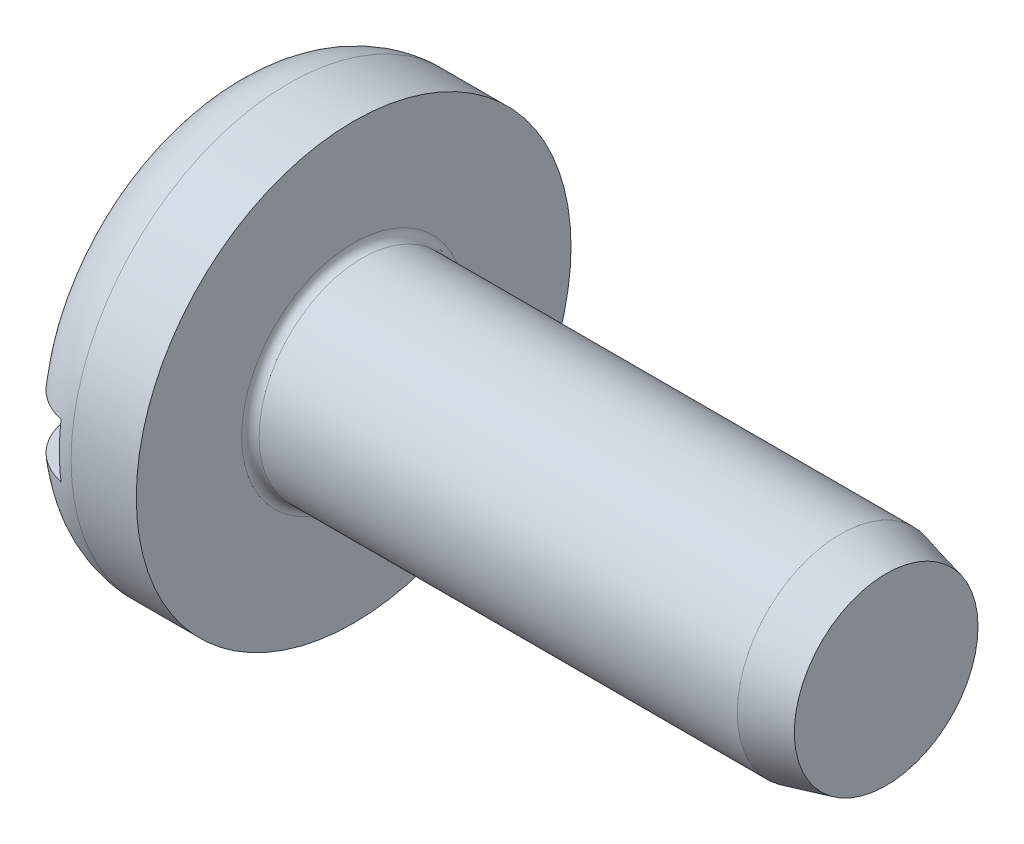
from build123d import *

# Parameters (mm, degrees)
SLOT_DEPTH      = 34.619190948
SLOT_DEPTH_BACK = 34.619190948
SKETCH2_W       = 2.4
SKETCH2_H       = 2.5
FILLET1_R       = 0.4


with BuildPart() as part:
    # Sketch1 → Base (revolve)
    with BuildSketch(Plane.XY, mode=Mode.PRIVATE) as base_sk:
        with BuildLine():
            Line((30.5, 0), (30.5, 4.75))
            Line((30.5, 4.75), (6, 4.75))
            Line((6, 4.75), (6, 10))
            Line((6, 10), (3, 10))
            ThreePointArc((3, 10), (0.878679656, 9.121320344), (0, 7))
            Line((0, 7), (0, 0))
            Line((0, 0), (30.5, 0))
        make_face()
    revolve(base_sk.sketch.rotate(Axis((-65.885195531, 0, 0), (1, 0, 0)), 90), axis=Axis((-65.885195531, 0, 0), (1, 0, 0)))

    # Sketch2 → Slot (cut, two sides: drawn at the far end of the back side and taken through both)
    with BuildSketch(Plane.XY.offset(-SLOT_DEPTH_BACK)):
        with Locations((1.2, 0)):
            Rectangle(SKETCH2_W, SKETCH2_H)
    extrude(amount=SLOT_DEPTH + SLOT_DEPTH_BACK, mode=Mode.SUBTRACT)

    # Fillet1
    fillet1_edges = [part.edges().sort_by_distance(p)[0] for p in [
        (6, 0, -4.75),
    ]]
    fillet(fillet1_edges, radius=FILLET1_R)

    # Sketch3 → Cut-Revolve1 (revolve, cut)
    with BuildSketch(Plane.XY, mode=Mode.PRIVATE) as cut_revolve1_sk:
        Polygon((26.3, -4.75), (28.4, -4.75), (30.5, -4.225), (30.5, -5.25), (26.3, -5.25), align=None)
    revolve(cut_revolve1_sk.sketch.rotate(Axis((1.328193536, 0, 0), (-1, 0, 0)), 90), axis=Axis((1.328193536, 0, 0), (-1, 0, 0)), mode=Mode.SUBTRACT)


solid = part.part
